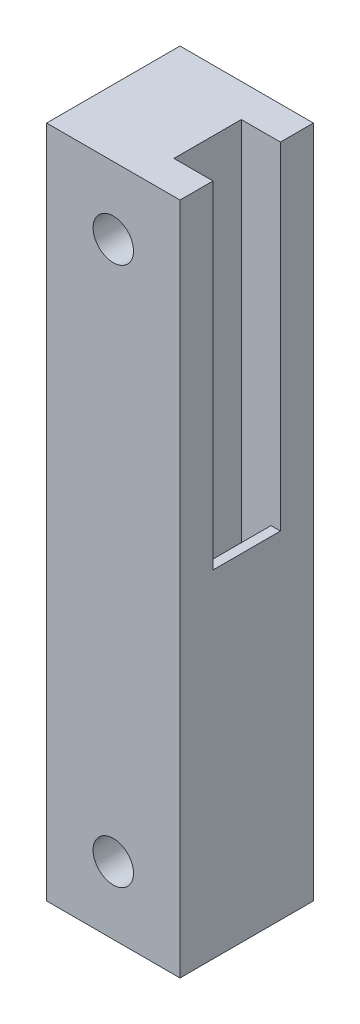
ISO-10303-21;
HEADER;
FILE_DESCRIPTION(('STEP AP214'),'2;1');
FILE_NAME('part.step','',(''),(''),'','','');
FILE_SCHEMA(('AUTOMOTIVE_DESIGN { 1 0 10303 214 1 1 1 1 }'));
ENDSEC;
DATA;
#1=APPLICATION_CONTEXT('core data for automotive mechanical design processes');
#2=APPLICATION_PROTOCOL_DEFINITION('international standard','automotive_design',2000,#1);
#3=PRODUCT_CONTEXT('',#1,'mechanical');
#4=PRODUCT('Part','Part','',(#3));
#5=PRODUCT_RELATED_PRODUCT_CATEGORY('part','',(#4));
#6=PRODUCT_DEFINITION_FORMATION('','',#4);
#7=PRODUCT_DEFINITION_CONTEXT('part definition',#1,'design');
#8=PRODUCT_DEFINITION('design','',#6,#7);
#9=PRODUCT_DEFINITION_SHAPE('','',#8);
#10=(LENGTH_UNIT() NAMED_UNIT(*) SI_UNIT(.MILLI.,.METRE.));
#11=(NAMED_UNIT(*) PLANE_ANGLE_UNIT() SI_UNIT($,.RADIAN.));
#12=(NAMED_UNIT(*) SI_UNIT($,.STERADIAN.) SOLID_ANGLE_UNIT());
#13=UNCERTAINTY_MEASURE_WITH_UNIT(LENGTH_MEASURE(1.E-05),#10,'distance_accuracy_value','');
#14=(GEOMETRIC_REPRESENTATION_CONTEXT(3) GLOBAL_UNCERTAINTY_ASSIGNED_CONTEXT((#13)) GLOBAL_UNIT_ASSIGNED_CONTEXT((#10,
#11,#12)) REPRESENTATION_CONTEXT('',''));
#15=CARTESIAN_POINT('',(0.,0.,0.));
#16=DIRECTION('',(0.,0.,1.));
#17=DIRECTION('',(1.,0.,0.));
#18=AXIS2_PLACEMENT_3D('',#15,#16,#17);
#19=CARTESIAN_POINT('',(3.45524177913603,50.,-2.39174146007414));
#20=DIRECTION('',(-1.,0.,0.));
#21=DIRECTION('',(0.,0.,1.));
#22=AXIS2_PLACEMENT_3D('',#19,#20,#21);
#23=PLANE('',#22);
#24=DIRECTION('',(0.,-1.,0.));
#25=VECTOR('',#24,1.);
#26=CARTESIAN_POINT('',(3.45524177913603,50.,2.60825853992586));
#27=LINE('',#26,#25);
#28=CARTESIAN_POINT('',(3.45524177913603,25.,2.60825853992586));
#29=VERTEX_POINT('',#28);
#30=CARTESIAN_POINT('',(3.45524177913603,0.,2.60825853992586));
#31=VERTEX_POINT('',#30);
#32=EDGE_CURVE('E156',#29,#31,#27,.T.);
#33=ORIENTED_EDGE('',*,*,#32,.F.);
#34=DIRECTION('',(0.,0.,-1.));
#35=VECTOR('',#34,1.);
#36=CARTESIAN_POINT('',(3.45524177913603,25.,-2.39174146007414));
#37=LINE('',#36,#35);
#38=CARTESIAN_POINT('',(3.45524177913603,25.,-2.39174146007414));
#39=VERTEX_POINT('',#38);
#40=EDGE_CURVE('E115',#29,#39,#37,.T.);
#41=ORIENTED_EDGE('',*,*,#40,.T.);
#42=DIRECTION('',(0.,-1.,0.));
#43=VECTOR('',#42,1.);
#44=CARTESIAN_POINT('',(3.45524177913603,50.,-2.39174146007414));
#45=LINE('',#44,#43);
#46=CARTESIAN_POINT('',(3.45524177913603,0.,-2.39174146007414));
#47=VERTEX_POINT('',#46);
#48=EDGE_CURVE('E171',#39,#47,#45,.T.);
#49=ORIENTED_EDGE('',*,*,#48,.T.);
#50=DIRECTION('',(0.,0.,-1.));
#51=VECTOR('',#50,1.);
#52=CARTESIAN_POINT('',(3.45524177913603,0.,-2.39174146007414));
#53=LINE('',#52,#51);
#54=EDGE_CURVE('E147',#31,#47,#53,.T.);
#55=ORIENTED_EDGE('',*,*,#54,.F.);
#56=EDGE_LOOP('',(#33,#41,#49,#55));
#57=FACE_BOUND('',#56,.T.);
#58=ADVANCED_FACE('F35',(#57),#23,.T.);
#59=CARTESIAN_POINT('',(0.,50.,0.));
#60=DIRECTION('',(0.,1.,0.));
#61=DIRECTION('',(0.,0.,1.));
#62=AXIS2_PLACEMENT_3D('',#59,#60,#61);
#63=PLANE('',#62);
#64=DIRECTION('',(-1.,0.,0.));
#65=VECTOR('',#64,1.);
#66=CARTESIAN_POINT('',(1.25524177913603,50.,-2.39174146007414));
#67=LINE('',#66,#65);
#68=CARTESIAN_POINT('',(4.15524177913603,50.,-2.39174146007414));
#69=VERTEX_POINT('',#68);
#70=CARTESIAN_POINT('',(1.25524177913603,50.,-2.39174146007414));
#71=VERTEX_POINT('',#70);
#72=EDGE_CURVE('E150',#69,#71,#67,.T.);
#73=ORIENTED_EDGE('',*,*,#72,.F.);
#74=DIRECTION('',(0.,0.,-1.));
#75=VECTOR('',#74,1.);
#76=CARTESIAN_POINT('',(4.15524177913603,50.,5.05825853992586));
#77=LINE('',#76,#75);
#78=CARTESIAN_POINT('',(4.15524177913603,50.,-4.84174146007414));
#79=VERTEX_POINT('',#78);
#80=EDGE_CURVE('E180',#69,#79,#77,.T.);
#81=ORIENTED_EDGE('',*,*,#80,.T.);
#82=DIRECTION('',(-1.,0.,0.));
#83=VECTOR('',#82,1.);
#84=CARTESIAN_POINT('',(4.15524177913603,50.,-4.84174146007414));
#85=LINE('',#84,#83);
#86=CARTESIAN_POINT('',(-5.74475822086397,50.,-4.84174146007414));
#87=VERTEX_POINT('',#86);
#88=EDGE_CURVE('E183',#79,#87,#85,.T.);
#89=ORIENTED_EDGE('',*,*,#88,.T.);
#90=DIRECTION('',(0.,0.,1.));
#91=VECTOR('',#90,1.);
#92=CARTESIAN_POINT('',(-5.74475822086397,50.,5.05825853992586));
#93=LINE('',#92,#91);
#94=CARTESIAN_POINT('',(-5.74475822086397,50.,5.05825853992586));
#95=VERTEX_POINT('',#94);
#96=EDGE_CURVE('E174',#87,#95,#93,.T.);
#97=ORIENTED_EDGE('',*,*,#96,.T.);
#98=DIRECTION('',(1.,0.,0.));
#99=VECTOR('',#98,1.);
#100=CARTESIAN_POINT('',(4.15524177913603,50.,5.05825853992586));
#101=LINE('',#100,#99);
#102=CARTESIAN_POINT('',(4.15524177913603,50.,5.05825853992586));
#103=VERTEX_POINT('',#102);
#104=EDGE_CURVE('E177',#95,#103,#101,.T.);
#105=ORIENTED_EDGE('',*,*,#104,.T.);
#106=CARTESIAN_POINT('',(4.15524177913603,50.,2.60825853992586));
#107=VERTEX_POINT('',#106);
#108=EDGE_CURVE('E181',#103,#107,#77,.T.);
#109=ORIENTED_EDGE('',*,*,#108,.T.);
#110=DIRECTION('',(1.,0.,0.));
#111=VECTOR('',#110,1.);
#112=CARTESIAN_POINT('',(1.25524177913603,50.,2.60825853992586));
#113=LINE('',#112,#111);
#114=CARTESIAN_POINT('',(1.25524177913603,50.,2.60825853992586));
#115=VERTEX_POINT('',#114);
#116=EDGE_CURVE('E122',#115,#107,#113,.T.);
#117=ORIENTED_EDGE('',*,*,#116,.F.);
#118=DIRECTION('',(0.,0.,1.));
#119=VECTOR('',#118,1.);
#120=CARTESIAN_POINT('',(1.25524177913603,50.,-2.39174146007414));
#121=LINE('',#120,#119);
#122=EDGE_CURVE('E152',#71,#115,#121,.T.);
#123=ORIENTED_EDGE('',*,*,#122,.F.);
#124=EDGE_LOOP('',(#73,#81,#89,#97,#105,#109,#117,#123));
#125=FACE_BOUND('',#124,.T.);
#126=ADVANCED_FACE('F215',(#125),#63,.T.);
#127=CARTESIAN_POINT('',(0.,0.,0.));
#128=DIRECTION('',(0.,1.,0.));
#129=DIRECTION('',(0.,0.,1.));
#130=AXIS2_PLACEMENT_3D('',#127,#128,#129);
#131=PLANE('',#130);
#132=DIRECTION('',(0.,0.,1.));
#133=VECTOR('',#132,1.);
#134=CARTESIAN_POINT('',(-5.74475822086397,0.,5.05825853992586));
#135=LINE('',#134,#133);
#136=CARTESIAN_POINT('',(-5.74475822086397,0.,-4.84174146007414));
#137=VERTEX_POINT('',#136);
#138=CARTESIAN_POINT('',(-5.74475822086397,0.,5.05825853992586));
#139=VERTEX_POINT('',#138);
#140=EDGE_CURVE('E173',#137,#139,#135,.T.);
#141=ORIENTED_EDGE('',*,*,#140,.F.);
#142=DIRECTION('',(-1.,0.,0.));
#143=VECTOR('',#142,1.);
#144=CARTESIAN_POINT('',(4.15524177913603,0.,-4.84174146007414));
#145=LINE('',#144,#143);
#146=CARTESIAN_POINT('',(4.15524177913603,0.,-4.84174146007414));
#147=VERTEX_POINT('',#146);
#148=EDGE_CURVE('E178',#147,#137,#145,.T.);
#149=ORIENTED_EDGE('',*,*,#148,.F.);
#150=DIRECTION('',(0.,0.,-1.));
#151=VECTOR('',#150,1.);
#152=CARTESIAN_POINT('',(4.15524177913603,0.,5.05825853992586));
#153=LINE('',#152,#151);
#154=CARTESIAN_POINT('',(4.15524177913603,0.,5.05825853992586));
#155=VERTEX_POINT('',#154);
#156=EDGE_CURVE('E190',#155,#147,#153,.T.);
#157=ORIENTED_EDGE('',*,*,#156,.F.);
#158=DIRECTION('',(1.,0.,0.));
#159=VECTOR('',#158,1.);
#160=CARTESIAN_POINT('',(4.15524177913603,0.,5.05825853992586));
#161=LINE('',#160,#159);
#162=EDGE_CURVE('E188',#139,#155,#161,.T.);
#163=ORIENTED_EDGE('',*,*,#162,.F.);
#164=EDGE_LOOP('',(#141,#149,#157,#163));
#165=FACE_BOUND('',#164,.T.);
#166=ORIENTED_EDGE('',*,*,#54,.T.);
#167=DIRECTION('',(-1.,0.,0.));
#168=VECTOR('',#167,1.);
#169=CARTESIAN_POINT('',(1.25524177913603,0.,-2.39174146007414));
#170=LINE('',#169,#168);
#171=CARTESIAN_POINT('',(1.25524177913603,0.,-2.39174146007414));
#172=VERTEX_POINT('',#171);
#173=EDGE_CURVE('E159',#47,#172,#170,.T.);
#174=ORIENTED_EDGE('',*,*,#173,.T.);
#175=DIRECTION('',(0.,0.,1.));
#176=VECTOR('',#175,1.);
#177=CARTESIAN_POINT('',(1.25524177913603,0.,-2.39174146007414));
#178=LINE('',#177,#176);
#179=CARTESIAN_POINT('',(1.25524177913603,0.,2.60825853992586));
#180=VERTEX_POINT('',#179);
#181=EDGE_CURVE('E162',#172,#180,#178,.T.);
#182=ORIENTED_EDGE('',*,*,#181,.T.);
#183=DIRECTION('',(1.,0.,0.));
#184=VECTOR('',#183,1.);
#185=CARTESIAN_POINT('',(1.25524177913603,0.,2.60825853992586));
#186=LINE('',#185,#184);
#187=EDGE_CURVE('E153',#180,#31,#186,.T.);
#188=ORIENTED_EDGE('',*,*,#187,.T.);
#189=EDGE_LOOP('',(#166,#174,#182,#188));
#190=FACE_BOUND('',#189,.T.);
#191=ADVANCED_FACE('F205',(#165,#190),#131,.F.);
#192=CARTESIAN_POINT('',(-5.74475822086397,50.,5.05825853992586));
#193=DIRECTION('',(1.,0.,0.));
#194=DIRECTION('',(0.,0.,-1.));
#195=AXIS2_PLACEMENT_3D('',#192,#193,#194);
#196=PLANE('',#195);
#197=ORIENTED_EDGE('',*,*,#140,.T.);
#198=DIRECTION('',(0.,-1.,0.));
#199=VECTOR('',#198,1.);
#200=CARTESIAN_POINT('',(-5.74475822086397,50.,5.05825853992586));
#201=LINE('',#200,#199);
#202=EDGE_CURVE('E11',#95,#139,#201,.T.);
#203=ORIENTED_EDGE('',*,*,#202,.F.);
#204=ORIENTED_EDGE('',*,*,#96,.F.);
#205=DIRECTION('',(0.,-1.,0.));
#206=VECTOR('',#205,1.);
#207=CARTESIAN_POINT('',(-5.74475822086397,50.,-4.84174146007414));
#208=LINE('',#207,#206);
#209=EDGE_CURVE('E185',#87,#137,#208,.T.);
#210=ORIENTED_EDGE('',*,*,#209,.T.);
#211=EDGE_LOOP('',(#197,#203,#204,#210));
#212=FACE_BOUND('',#211,.T.);
#213=ADVANCED_FACE('F37',(#212),#196,.F.);
#214=CARTESIAN_POINT('',(4.15524177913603,50.,5.05825853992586));
#215=DIRECTION('',(0.,0.,-1.));
#216=DIRECTION('',(-1.,0.,0.));
#217=AXIS2_PLACEMENT_3D('',#214,#215,#216);
#218=PLANE('',#217);
#219=CARTESIAN_POINT('',(-0.794758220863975,5.,5.05825853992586));
#220=DIRECTION('',(0.,0.,-1.));
#221=DIRECTION('',(-1.,0.,0.));
#222=AXIS2_PLACEMENT_3D('',#219,#220,#221);
#223=CIRCLE('',#222,1.5);
#224=CARTESIAN_POINT('',(-2.29475822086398,5.,5.05825853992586));
#225=VERTEX_POINT('',#224);
#226=EDGE_CURVE('E138',#225,#225,#223,.T.);
#227=ORIENTED_EDGE('',*,*,#226,.T.);
#228=EDGE_LOOP('',(#227));
#229=FACE_BOUND('',#228,.T.);
#230=CARTESIAN_POINT('',(-0.794758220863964,45.,5.05825853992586));
#231=DIRECTION('',(0.,0.,-1.));
#232=DIRECTION('',(-1.,0.,0.));
#233=AXIS2_PLACEMENT_3D('',#230,#231,#232);
#234=CIRCLE('',#233,1.5);
#235=CARTESIAN_POINT('',(-2.29475822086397,45.,5.05825853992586));
#236=VERTEX_POINT('',#235);
#237=EDGE_CURVE('E144',#236,#236,#234,.T.);
#238=ORIENTED_EDGE('',*,*,#237,.T.);
#239=EDGE_LOOP('',(#238));
#240=FACE_BOUND('',#239,.T.);
#241=ORIENTED_EDGE('',*,*,#162,.T.);
#242=DIRECTION('',(0.,-1.,0.));
#243=VECTOR('',#242,1.);
#244=CARTESIAN_POINT('',(4.15524177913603,50.,5.05825853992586));
#245=LINE('',#244,#243);
#246=EDGE_CURVE('E43',#103,#155,#245,.T.);
#247=ORIENTED_EDGE('',*,*,#246,.F.);
#248=ORIENTED_EDGE('',*,*,#104,.F.);
#249=ORIENTED_EDGE('',*,*,#202,.T.);
#250=EDGE_LOOP('',(#241,#247,#248,#249));
#251=FACE_BOUND('',#250,.T.);
#252=ADVANCED_FACE('F249',(#229,#240,#251),#218,.F.);
#253=CARTESIAN_POINT('',(4.15524177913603,50.,5.05825853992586));
#254=DIRECTION('',(-1.,0.,0.));
#255=DIRECTION('',(0.,0.,1.));
#256=AXIS2_PLACEMENT_3D('',#253,#254,#255);
#257=PLANE('',#256);
#258=ORIENTED_EDGE('',*,*,#80,.F.);
#259=DIRECTION('',(0.,1.,0.));
#260=VECTOR('',#259,1.);
#261=CARTESIAN_POINT('',(4.15524177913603,25.,-2.39174146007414));
#262=LINE('',#261,#260);
#263=CARTESIAN_POINT('',(4.15524177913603,25.,-2.39174146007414));
#264=VERTEX_POINT('',#263);
#265=EDGE_CURVE('E126',#264,#69,#262,.T.);
#266=ORIENTED_EDGE('',*,*,#265,.F.);
#267=DIRECTION('',(0.,0.,-1.));
#268=VECTOR('',#267,1.);
#269=CARTESIAN_POINT('',(4.15524177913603,25.,2.60825853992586));
#270=LINE('',#269,#268);
#271=CARTESIAN_POINT('',(4.15524177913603,25.,2.60825853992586));
#272=VERTEX_POINT('',#271);
#273=EDGE_CURVE('E114',#272,#264,#270,.T.);
#274=ORIENTED_EDGE('',*,*,#273,.F.);
#275=DIRECTION('',(0.,1.,0.));
#276=VECTOR('',#275,1.);
#277=CARTESIAN_POINT('',(4.15524177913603,25.,2.60825853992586));
#278=LINE('',#277,#276);
#279=EDGE_CURVE('E119',#272,#107,#278,.T.);
#280=ORIENTED_EDGE('',*,*,#279,.T.);
#281=ORIENTED_EDGE('',*,*,#108,.F.);
#282=ORIENTED_EDGE('',*,*,#246,.T.);
#283=ORIENTED_EDGE('',*,*,#156,.T.);
#284=DIRECTION('',(0.,-1.,0.));
#285=VECTOR('',#284,1.);
#286=CARTESIAN_POINT('',(4.15524177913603,50.,-4.84174146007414));
#287=LINE('',#286,#285);
#288=EDGE_CURVE('E195',#79,#147,#287,.T.);
#289=ORIENTED_EDGE('',*,*,#288,.F.);
#290=EDGE_LOOP('',(#258,#266,#274,#280,#281,#282,#283,#289));
#291=FACE_BOUND('',#290,.T.);
#292=ADVANCED_FACE('F130',(#291),#257,.F.);
#293=CARTESIAN_POINT('',(4.15524177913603,50.,-4.84174146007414));
#294=DIRECTION('',(0.,0.,1.));
#295=DIRECTION('',(1.,0.,0.));
#296=AXIS2_PLACEMENT_3D('',#293,#294,#295);
#297=PLANE('',#296);
#298=CARTESIAN_POINT('',(-0.794758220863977,5.,-4.84174146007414));
#299=DIRECTION('',(0.,0.,-1.));
#300=DIRECTION('',(-1.,0.,0.));
#301=AXIS2_PLACEMENT_3D('',#298,#299,#300);
#302=CIRCLE('',#301,1.5);
#303=CARTESIAN_POINT('',(-2.29475822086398,5.,-4.84174146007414));
#304=VERTEX_POINT('',#303);
#305=EDGE_CURVE('E137',#304,#304,#302,.T.);
#306=ORIENTED_EDGE('',*,*,#305,.F.);
#307=EDGE_LOOP('',(#306));
#308=FACE_BOUND('',#307,.T.);
#309=CARTESIAN_POINT('',(-0.794758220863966,45.,-4.84174146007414));
#310=DIRECTION('',(0.,0.,-1.));
#311=DIRECTION('',(-1.,0.,0.));
#312=AXIS2_PLACEMENT_3D('',#309,#310,#311);
#313=CIRCLE('',#312,1.5);
#314=CARTESIAN_POINT('',(-2.29475822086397,45.,-4.84174146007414));
#315=VERTEX_POINT('',#314);
#316=EDGE_CURVE('E141',#315,#315,#313,.T.);
#317=ORIENTED_EDGE('',*,*,#316,.F.);
#318=EDGE_LOOP('',(#317));
#319=FACE_BOUND('',#318,.T.);
#320=ORIENTED_EDGE('',*,*,#148,.T.);
#321=ORIENTED_EDGE('',*,*,#209,.F.);
#322=ORIENTED_EDGE('',*,*,#88,.F.);
#323=ORIENTED_EDGE('',*,*,#288,.T.);
#324=EDGE_LOOP('',(#320,#321,#322,#323));
#325=FACE_BOUND('',#324,.T.);
#326=ADVANCED_FACE('F209',(#308,#319,#325),#297,.F.);
#327=CARTESIAN_POINT('',(1.25524177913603,50.,-2.39174146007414));
#328=DIRECTION('',(0.,0.,1.));
#329=DIRECTION('',(1.,0.,0.));
#330=AXIS2_PLACEMENT_3D('',#327,#328,#329);
#331=PLANE('',#330);
#332=DIRECTION('',(0.,-1.,0.));
#333=VECTOR('',#332,1.);
#334=CARTESIAN_POINT('',(1.25524177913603,50.,-2.39174146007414));
#335=LINE('',#334,#333);
#336=EDGE_CURVE('E169',#71,#172,#335,.T.);
#337=ORIENTED_EDGE('',*,*,#336,.T.);
#338=ORIENTED_EDGE('',*,*,#173,.F.);
#339=ORIENTED_EDGE('',*,*,#48,.F.);
#340=DIRECTION('',(-1.,0.,0.));
#341=VECTOR('',#340,1.);
#342=CARTESIAN_POINT('',(4.15524177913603,25.,-2.39174146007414));
#343=LINE('',#342,#341);
#344=EDGE_CURVE('E50',#264,#39,#343,.T.);
#345=ORIENTED_EDGE('',*,*,#344,.F.);
#346=ORIENTED_EDGE('',*,*,#265,.T.);
#347=ORIENTED_EDGE('',*,*,#72,.T.);
#348=EDGE_LOOP('',(#337,#338,#339,#345,#346,#347));
#349=FACE_BOUND('',#348,.T.);
#350=ADVANCED_FACE('F219',(#349),#331,.T.);
#351=CARTESIAN_POINT('',(1.25524177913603,50.,-2.39174146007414));
#352=DIRECTION('',(1.,0.,0.));
#353=DIRECTION('',(0.,0.,-1.));
#354=AXIS2_PLACEMENT_3D('',#351,#352,#353);
#355=PLANE('',#354);
#356=DIRECTION('',(0.,-1.,0.));
#357=VECTOR('',#356,1.);
#358=CARTESIAN_POINT('',(1.25524177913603,50.,2.60825853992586));
#359=LINE('',#358,#357);
#360=EDGE_CURVE('E58',#115,#180,#359,.T.);
#361=ORIENTED_EDGE('',*,*,#360,.T.);
#362=ORIENTED_EDGE('',*,*,#181,.F.);
#363=ORIENTED_EDGE('',*,*,#336,.F.);
#364=ORIENTED_EDGE('',*,*,#122,.T.);
#365=EDGE_LOOP('',(#361,#362,#363,#364));
#366=FACE_BOUND('',#365,.T.);
#367=ADVANCED_FACE('F226',(#366),#355,.T.);
#368=CARTESIAN_POINT('',(1.25524177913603,50.,2.60825853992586));
#369=DIRECTION('',(0.,0.,-1.));
#370=DIRECTION('',(-1.,0.,0.));
#371=AXIS2_PLACEMENT_3D('',#368,#369,#370);
#372=PLANE('',#371);
#373=ORIENTED_EDGE('',*,*,#116,.T.);
#374=ORIENTED_EDGE('',*,*,#279,.F.);
#375=DIRECTION('',(1.,0.,0.));
#376=VECTOR('',#375,1.);
#377=CARTESIAN_POINT('',(1.25524177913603,25.,2.60825853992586));
#378=LINE('',#377,#376);
#379=EDGE_CURVE('E110',#29,#272,#378,.T.);
#380=ORIENTED_EDGE('',*,*,#379,.F.);
#381=ORIENTED_EDGE('',*,*,#32,.T.);
#382=ORIENTED_EDGE('',*,*,#187,.F.);
#383=ORIENTED_EDGE('',*,*,#360,.F.);
#384=EDGE_LOOP('',(#373,#374,#380,#381,#382,#383));
#385=FACE_BOUND('',#384,.T.);
#386=ADVANCED_FACE('F120',(#385),#372,.T.);
#387=CARTESIAN_POINT('',(-0.794758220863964,45.,5.05825853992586));
#388=DIRECTION('',(0.,0.,-1.));
#389=DIRECTION('',(-1.,0.,0.));
#390=AXIS2_PLACEMENT_3D('',#387,#388,#389);
#391=CYLINDRICAL_SURFACE('',#390,1.5);
#392=ORIENTED_EDGE('',*,*,#237,.F.);
#393=EDGE_LOOP('',(#392));
#394=FACE_BOUND('',#393,.T.);
#395=ORIENTED_EDGE('',*,*,#316,.T.);
#396=EDGE_LOOP('',(#395));
#397=FACE_BOUND('',#396,.T.);
#398=ADVANCED_FACE('F233',(#394,#397),#391,.F.);
#399=CARTESIAN_POINT('',(-0.794758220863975,5.,5.05825853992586));
#400=DIRECTION('',(0.,0.,-1.));
#401=DIRECTION('',(-1.,0.,0.));
#402=AXIS2_PLACEMENT_3D('',#399,#400,#401);
#403=CYLINDRICAL_SURFACE('',#402,1.5);
#404=ORIENTED_EDGE('',*,*,#226,.F.);
#405=EDGE_LOOP('',(#404));
#406=FACE_BOUND('',#405,.T.);
#407=ORIENTED_EDGE('',*,*,#305,.T.);
#408=EDGE_LOOP('',(#407));
#409=FACE_BOUND('',#408,.T.);
#410=ADVANCED_FACE('F261',(#406,#409),#403,.F.);
#411=CARTESIAN_POINT('',(0.,25.,0.));
#412=DIRECTION('',(0.,1.,0.));
#413=DIRECTION('',(0.,0.,1.));
#414=AXIS2_PLACEMENT_3D('',#411,#412,#413);
#415=PLANE('',#414);
#416=ORIENTED_EDGE('',*,*,#379,.T.);
#417=ORIENTED_EDGE('',*,*,#273,.T.);
#418=ORIENTED_EDGE('',*,*,#344,.T.);
#419=ORIENTED_EDGE('',*,*,#40,.F.);
#420=EDGE_LOOP('',(#416,#417,#418,#419));
#421=FACE_BOUND('',#420,.T.);
#422=ADVANCED_FACE('F112',(#421),#415,.T.);
#423=CLOSED_SHELL('',(#58,#126,#191,#213,#252,#292,#326,#350,#367,#386,#398,#410,#422));
#424=MANIFOLD_SOLID_BREP('B2',#423);
#425=ADVANCED_BREP_SHAPE_REPRESENTATION('',(#18,#424),#14);
#426=SHAPE_DEFINITION_REPRESENTATION(#9,#425);
ENDSEC;
END-ISO-10303-21;
